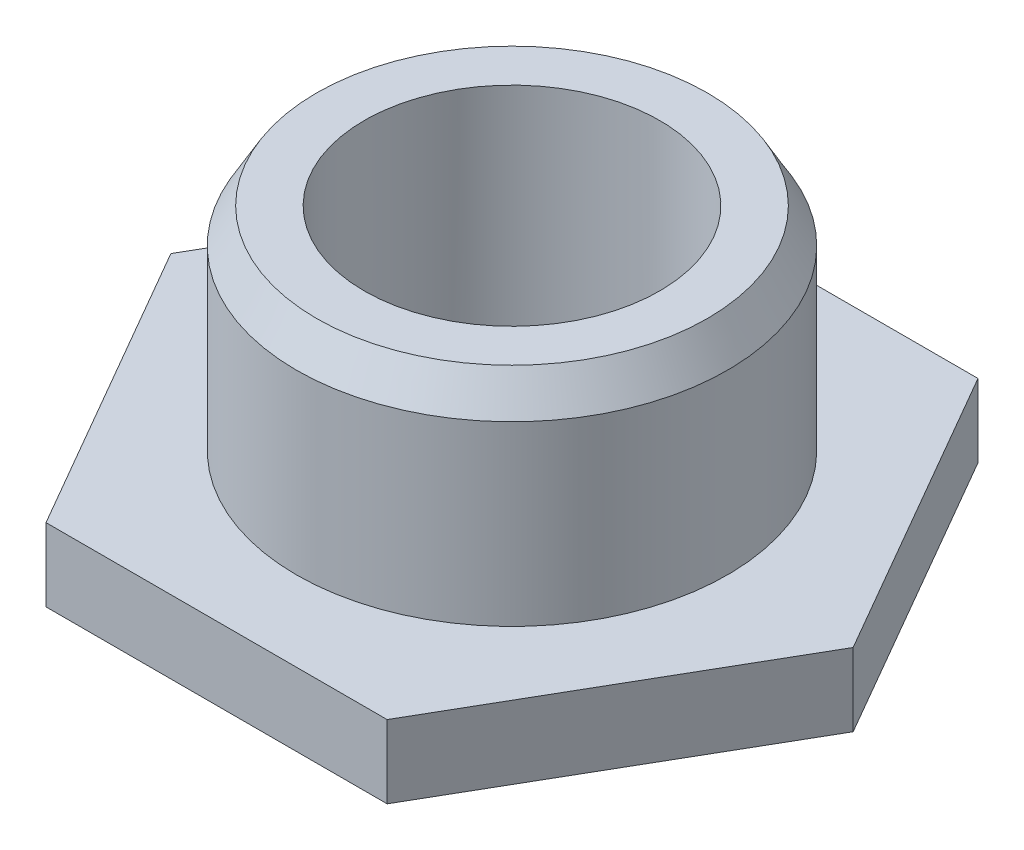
from build123d import *

# Parameters (mm, degrees)
BOSS_EXTRUDE1_DEPTH = 2.1
SKETCH2_R           = 6.2
BOSS_EXTRUDE2_DEPTH = 6.1
SKETCH4_R           = 4.25
CUT_EXTRUDE1_DEPTH  = 16.356540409
CHAMFER1_SIZE       = 1
CHAMFER1_SIZE2      = 0.577350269


with BuildPart() as part:
    # Sketch1 → Boss-Extrude1 (new body)
    with BuildSketch(Plane(origin=(0, 0, 0), x_dir=(1, 0, 0), z_dir=(0, 1, 0))):
        Polygon((9.814954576, 0), (4.907477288, 8.5), (-4.907477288, 8.5), (-9.814954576, 0), (-4.907477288, -8.5), (4.907477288, -8.5), align=None)
    extrude(amount=BOSS_EXTRUDE1_DEPTH)

    # Sketch2 → Boss-Extrude2 (add)
    with BuildSketch(Plane(origin=(0, 2.1, 0), x_dir=(1, 0, 0), z_dir=(0, 1, 0))):
        with Locations(Location((0, 0, 0), (0, 0, 270))):
            Circle(SKETCH2_R)
    extrude(amount=BOSS_EXTRUDE2_DEPTH)

    # Sketch3 → Cut-Revolve1 (revolve, cut)
    with BuildSketch(Plane(origin=(0, 0, 0), x_dir=(0, 0, -1), z_dir=(1, 0, 0))):
        Polygon((0, 3), (7.7, 0), (0, 0), align=None)
    revolve(axis=Axis((0, 0, 0), (0, 1, 0)), mode=Mode.SUBTRACT)

    # Sketch4 → Cut-Extrude1 (cut, through all)
    with BuildSketch(Plane(origin=(0, 8.2, 0), x_dir=(1, 0, 0), z_dir=(0, 1, 0))):
        with Locations(Location((0, 0, 0), (0, 0, 270))):
            Circle(SKETCH4_R)
    extrude(amount=-CUT_EXTRUDE1_DEPTH, mode=Mode.SUBTRACT)

    # Chamfer1
    chamfer1_edges = [part.edges().sort_by_distance(p)[0] for p in [
        (0, 8.2, -6.2),
    ]]
    chamfer1_side = [part.faces().sort_by_distance(p)[0] for p in [
        (0, 5.15, -6.2),
    ]]
    chamfer(chamfer1_edges, length=CHAMFER1_SIZE, length2=CHAMFER1_SIZE2, reference=chamfer1_side[0])


solid = part.part
